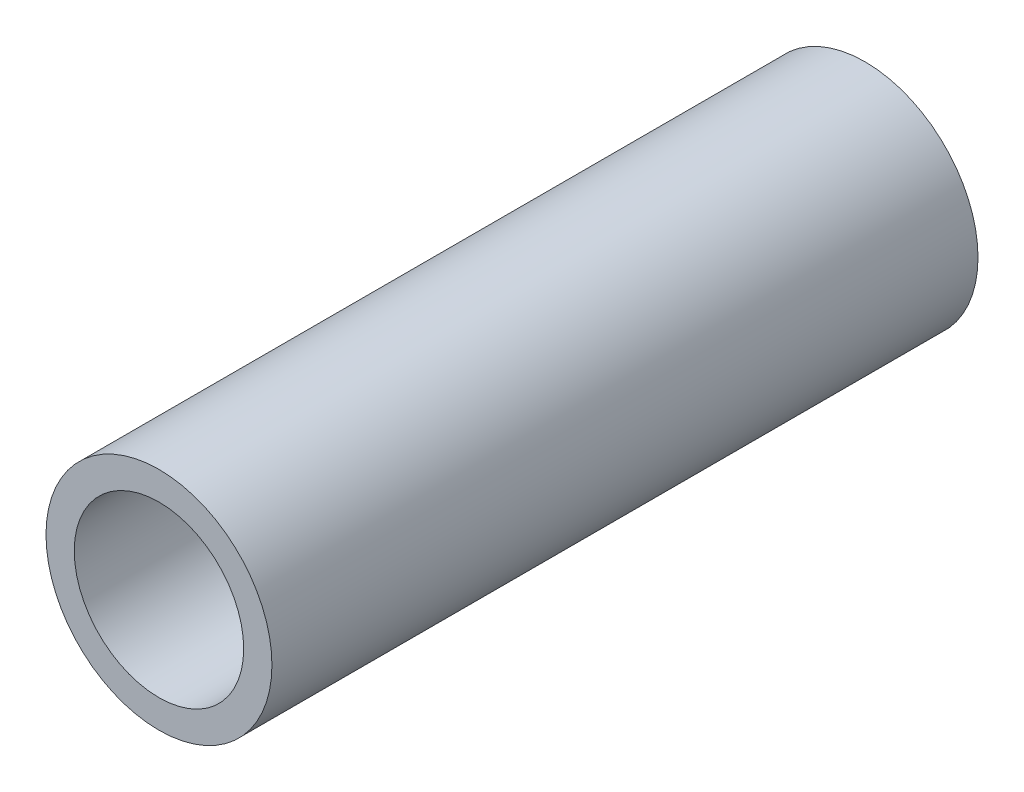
ISO-10303-21;
HEADER;
FILE_DESCRIPTION(('STEP AP214'),'2;1');
FILE_NAME('part.step','',(''),(''),'','','');
FILE_SCHEMA(('AUTOMOTIVE_DESIGN { 1 0 10303 214 1 1 1 1 }'));
ENDSEC;
DATA;
#1=APPLICATION_CONTEXT('core data for automotive mechanical design processes');
#2=APPLICATION_PROTOCOL_DEFINITION('international standard','automotive_design',2000,#1);
#3=PRODUCT_CONTEXT('',#1,'mechanical');
#4=PRODUCT('Part','Part','',(#3));
#5=PRODUCT_RELATED_PRODUCT_CATEGORY('part','',(#4));
#6=PRODUCT_DEFINITION_FORMATION('','',#4);
#7=PRODUCT_DEFINITION_CONTEXT('part definition',#1,'design');
#8=PRODUCT_DEFINITION('design','',#6,#7);
#9=PRODUCT_DEFINITION_SHAPE('','',#8);
#10=(LENGTH_UNIT() NAMED_UNIT(*) SI_UNIT(.MILLI.,.METRE.));
#11=(NAMED_UNIT(*) PLANE_ANGLE_UNIT() SI_UNIT($,.RADIAN.));
#12=(NAMED_UNIT(*) SI_UNIT($,.STERADIAN.) SOLID_ANGLE_UNIT());
#13=UNCERTAINTY_MEASURE_WITH_UNIT(LENGTH_MEASURE(1.E-05),#10,'distance_accuracy_value','');
#14=(GEOMETRIC_REPRESENTATION_CONTEXT(3) GLOBAL_UNCERTAINTY_ASSIGNED_CONTEXT((#13)) GLOBAL_UNIT_ASSIGNED_CONTEXT((#10,
#11,#12)) REPRESENTATION_CONTEXT('',''));
#15=CARTESIAN_POINT('',(0.,0.,0.));
#16=DIRECTION('',(0.,0.,1.));
#17=DIRECTION('',(1.,0.,0.));
#18=AXIS2_PLACEMENT_3D('',#15,#16,#17);
#19=CARTESIAN_POINT('',(0.,0.,50.));
#20=DIRECTION('',(0.,0.,1.));
#21=DIRECTION('',(1.,0.,0.));
#22=AXIS2_PLACEMENT_3D('',#19,#20,#21);
#23=PLANE('',#22);
#24=CARTESIAN_POINT('',(0.,0.,50.));
#25=DIRECTION('',(0.,0.,1.));
#26=DIRECTION('',(1.,0.,0.));
#27=AXIS2_PLACEMENT_3D('',#24,#25,#26);
#28=CIRCLE('',#27,8.);
#29=CARTESIAN_POINT('',(8.,0.,50.));
#30=VERTEX_POINT('',#29);
#31=EDGE_CURVE('E12',#30,#30,#28,.T.);
#32=ORIENTED_EDGE('',*,*,#31,.T.);
#33=EDGE_LOOP('',(#32));
#34=FACE_BOUND('',#33,.T.);
#35=CARTESIAN_POINT('',(0.,0.,50.));
#36=DIRECTION('',(0.,0.,1.));
#37=DIRECTION('',(1.,0.,0.));
#38=AXIS2_PLACEMENT_3D('',#35,#36,#37);
#39=CIRCLE('',#38,6.);
#40=CARTESIAN_POINT('',(6.,0.,50.));
#41=VERTEX_POINT('',#40);
#42=EDGE_CURVE('E51',#41,#41,#39,.T.);
#43=ORIENTED_EDGE('',*,*,#42,.F.);
#44=EDGE_LOOP('',(#43));
#45=FACE_BOUND('',#44,.T.);
#46=ADVANCED_FACE('F40',(#34,#45),#23,.T.);
#47=CARTESIAN_POINT('',(0.,0.,0.));
#48=DIRECTION('',(0.,0.,1.));
#49=DIRECTION('',(1.,0.,0.));
#50=AXIS2_PLACEMENT_3D('',#47,#48,#49);
#51=PLANE('',#50);
#52=CARTESIAN_POINT('',(0.,0.,0.));
#53=DIRECTION('',(0.,0.,1.));
#54=DIRECTION('',(1.,0.,0.));
#55=AXIS2_PLACEMENT_3D('',#52,#53,#54);
#56=CIRCLE('',#55,8.);
#57=CARTESIAN_POINT('',(8.,0.,0.));
#58=VERTEX_POINT('',#57);
#59=EDGE_CURVE('E44',#58,#58,#56,.T.);
#60=ORIENTED_EDGE('',*,*,#59,.F.);
#61=EDGE_LOOP('',(#60));
#62=FACE_BOUND('',#61,.T.);
#63=CARTESIAN_POINT('',(0.,0.,0.));
#64=DIRECTION('',(0.,0.,1.));
#65=DIRECTION('',(1.,0.,0.));
#66=AXIS2_PLACEMENT_3D('',#63,#64,#65);
#67=CIRCLE('',#66,6.);
#68=CARTESIAN_POINT('',(6.,0.,0.));
#69=VERTEX_POINT('',#68);
#70=EDGE_CURVE('E53',#69,#69,#67,.T.);
#71=ORIENTED_EDGE('',*,*,#70,.T.);
#72=EDGE_LOOP('',(#71));
#73=FACE_BOUND('',#72,.T.);
#74=ADVANCED_FACE('F63',(#62,#73),#51,.F.);
#75=CARTESIAN_POINT('',(0.,0.,50.));
#76=DIRECTION('',(0.,0.,-1.));
#77=DIRECTION('',(-1.,0.,0.));
#78=AXIS2_PLACEMENT_3D('',#75,#76,#77);
#79=CYLINDRICAL_SURFACE('',#78,8.);
#80=ORIENTED_EDGE('',*,*,#31,.F.);
#81=EDGE_LOOP('',(#80));
#82=FACE_BOUND('',#81,.T.);
#83=ORIENTED_EDGE('',*,*,#59,.T.);
#84=EDGE_LOOP('',(#83));
#85=FACE_BOUND('',#84,.T.);
#86=ADVANCED_FACE('F42',(#82,#85),#79,.T.);
#87=CARTESIAN_POINT('',(0.,0.,50.));
#88=DIRECTION('',(0.,0.,-1.));
#89=DIRECTION('',(-1.,0.,0.));
#90=AXIS2_PLACEMENT_3D('',#87,#88,#89);
#91=CYLINDRICAL_SURFACE('',#90,6.);
#92=ORIENTED_EDGE('',*,*,#42,.T.);
#93=EDGE_LOOP('',(#92));
#94=FACE_BOUND('',#93,.T.);
#95=ORIENTED_EDGE('',*,*,#70,.F.);
#96=EDGE_LOOP('',(#95));
#97=FACE_BOUND('',#96,.T.);
#98=ADVANCED_FACE('F59',(#94,#97),#91,.F.);
#99=CLOSED_SHELL('',(#46,#74,#86,#98));
#100=MANIFOLD_SOLID_BREP('B2',#99);
#101=ADVANCED_BREP_SHAPE_REPRESENTATION('',(#18,#100),#14);
#102=SHAPE_DEFINITION_REPRESENTATION(#9,#101);
ENDSEC;
END-ISO-10303-21;
